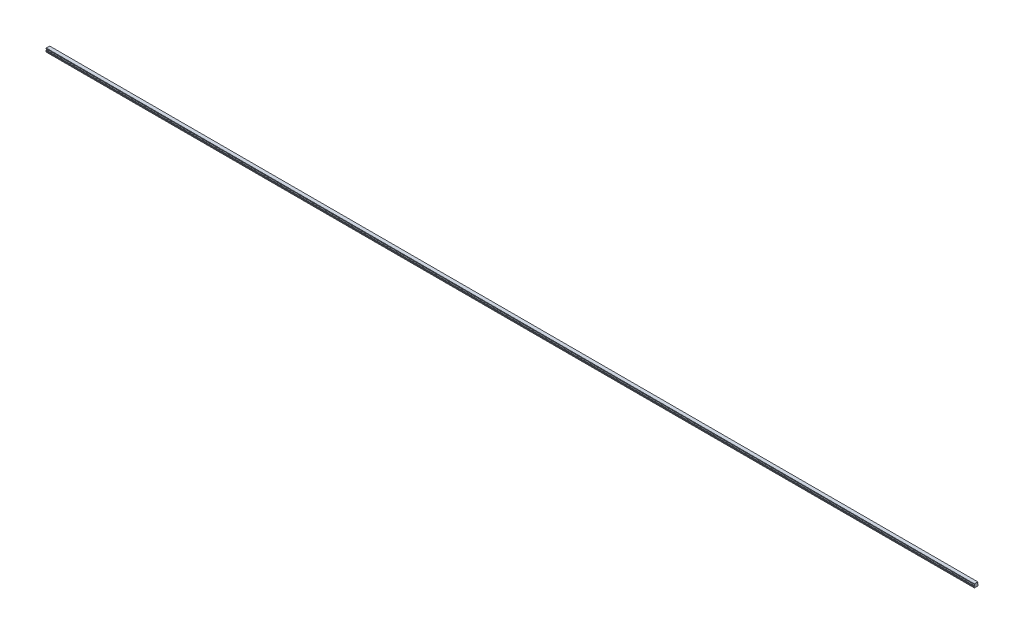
from build123d import *

# Parameters (mm, degrees)
BOSS_EXTRUDE1_DEPTH        = 3540
SKETCH3_R                  = 2.5
SKETCH3_R_2                = 2.1
CUT_EXTRUDE3_DEPTH         = 7
SKETCH3_2_R                = 2.1
CUT_EXTRUDE4_DEPTH         = 9.5
CHAMFER1_SIZE              = 0.4
LPATTERN2_COUNT            = 59
LPATTERN2_PITCH            = 60
CHAMFER1_OF_LPATTERN2_SIZE = 0.4


with BuildPart() as part:
    # Sketch1 → Boss-Extrude1 (new body)
    with BuildSketch(Plane(origin=(0, 0, 0), x_dir=(0, 0, -1), z_dir=(1, 0, 0))):
        with BuildLine():
            Line((6.59, 14), (-6.59, 14))
            Line((-6.59, 14), (-6.59, 13.15))
            Line((-6.59, 13.15), (-6.96, 12.356532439))
            Line((-6.96, 12.356532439), (-6.96, 11.435174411))
            ThreePointArc((-6.96, 11.435174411), (-5.25, 9.5), (-6.96, 7.564825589))
            Line((-6.96, 7.564825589), (-6.96, 6.643467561))
            Line((-6.96, 6.643467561), (-6.59, 5.85))
            Line((-6.59, 5.85), (-7.032116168, 4.2))
            Line((-7.032116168, 4.2), (-7.5, 3.929867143))
            Line((-7.5, 3.929867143), (-7.5, 1.4))
            Line((-7.5, 1.4), (-6.1, 0))
            Line((-6.1, 0), (-3.65, 0))
            Line((-3.65, 0), (-3.25, 0.4))
            Line((-3.25, 0.4), (3.25, 0.4))
            Line((3.25, 0.4), (3.65, 0))
            Line((3.65, 0), (6.1, 0))
            Line((6.1, 0), (7.5, 1.4))
            Line((7.5, 1.4), (7.5, 3.929867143))
            Line((7.5, 3.929867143), (7.032116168, 4.2))
            Line((7.032116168, 4.2), (6.59, 5.85))
            Line((6.59, 5.85), (6.96, 6.643467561))
            Line((6.96, 6.643467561), (6.96, 7.564825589))
            ThreePointArc((6.96, 7.564825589), (5.25, 9.5), (6.96, 11.435174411))
            Line((6.96, 11.435174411), (6.96, 12.356532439))
            Line((6.96, 12.356532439), (6.59, 13.15))
            Line((6.59, 13.15), (6.59, 14))
        make_face()
    extrude(amount=BOSS_EXTRUDE1_DEPTH)

    # Sketch3 → Cut-Extrude3 (cut)
    with BuildSketch(Plane.XZ):
        with Locations(Location((30, 0, 0), (0, 0, 270))):
            Circle(SKETCH3_R)
        with Locations(Location((30, 0, 0), (0, 0, 270))):
            Circle(SKETCH3_R_2, mode=Mode.SUBTRACT)
    cut_extrude3 = extrude(amount=-CUT_EXTRUDE3_DEPTH, mode=Mode.SUBTRACT)

    # Sketch3_2 → Cut-Extrude4 (cut)
    with BuildSketch(Plane.XZ):
        with Locations(Location((30, 0, 0), (0, 0, 270))):
            Circle(SKETCH3_2_R)
    cut_extrude4 = extrude(amount=-CUT_EXTRUDE4_DEPTH, mode=Mode.SUBTRACT)

    # Cut-Extrude5 cone 1 section (on through the dimple's axis) → Cut-Extrude5 (revolve, cut)
    with BuildSketch(Plane(origin=(30, 9.5, 0), x_dir=(0, 0, -1), z_dir=(1, 0, 0))):
        Polygon((0, 0), (2.1, 0), (0, 1.212435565), align=None)
    revolve(axis=Axis((30, 9.5, 0), (0, 1, 0)), mode=Mode.SUBTRACT)

    # Chamfer1
    chamfer1_edges = [part.edges().sort_by_distance(p)[0] for p in [
        (30, 0.4, 2.5),
    ]]
    chamfer(chamfer1_edges, length=CHAMFER1_SIZE)

    # LPattern2: Cut-Extrude3, Cut-Extrude4 ×59
    with Locations(*[(i * LPATTERN2_PITCH, 0, 0) for i in range(1, LPATTERN2_COUNT)]):
        add(cut_extrude3, mode=Mode.SUBTRACT)
        add(cut_extrude4, mode=Mode.SUBTRACT)

    # Chamfer1 of LPattern2
    chamfer1_of_lpattern2_edges = [part.edges().sort_by_distance(p)[0] for p in [
        (90, 0.4, 2.5),
        (150, 0.4, 2.5),
        (210, 0.4, 2.5),
        (270, 0.4, 2.5),
        (330, 0.4, 2.5),
        (390, 0.4, 2.5),
        (450, 0.4, 2.5),
        (510, 0.4, 2.5),
        (570, 0.4, 2.5),
        (630, 0.4, 2.5),
        (690, 0.4, 2.5),
        (750, 0.4, 2.5),
        (810, 0.4, 2.5),
        (870, 0.4, 2.5),
        (930, 0.4, 2.5),
        (990, 0.4, 2.5),
        (1050, 0.4, 2.5),
        (1110, 0.4, 2.5),
        (1170, 0.4, 2.5),
        (1230, 0.4, 2.5),
        (1290, 0.4, 2.5),
        (1350, 0.4, 2.5),
        (1410, 0.4, 2.5),
        (1470, 0.4, 2.5),
        (1530, 0.4, 2.5),
        (1590, 0.4, 2.5),
        (1650, 0.4, 2.5),
        (1710, 0.4, 2.5),
        (1770, 0.4, 2.5),
        (1830, 0.4, 2.5),
        (1890, 0.4, 2.5),
        (1950, 0.4, 2.5),
        (2010, 0.4, 2.5),
        (2070, 0.4, 2.5),
        (2130, 0.4, 2.5),
        (2190, 0.4, 2.5),
        (2250, 0.4, 2.5),
        (2310, 0.4, 2.5),
        (2370, 0.4, 2.5),
        (2430, 0.4, 2.5),
        (2490, 0.4, 2.5),
        (2550, 0.4, 2.5),
        (2610, 0.4, 2.5),
        (2670, 0.4, 2.5),
        (2730, 0.4, 2.5),
        (2790, 0.4, 2.5),
        (2850, 0.4, 2.5),
        (2910, 0.4, 2.5),
        (2970, 0.4, 2.5),
        (3030, 0.4, 2.5),
        (3090, 0.4, 2.5),
        (3150, 0.4, 2.5),
        (3210, 0.4, 2.5),
        (3270, 0.4, 2.5),
        (3330, 0.4, 2.5),
        (3390, 0.4, 2.5),
        (3450, 0.4, 2.5),
        (3510, 0.4, 2.5),
    ]]
    chamfer(chamfer1_of_lpattern2_edges, length=CHAMFER1_OF_LPATTERN2_SIZE)


solid = part.part
